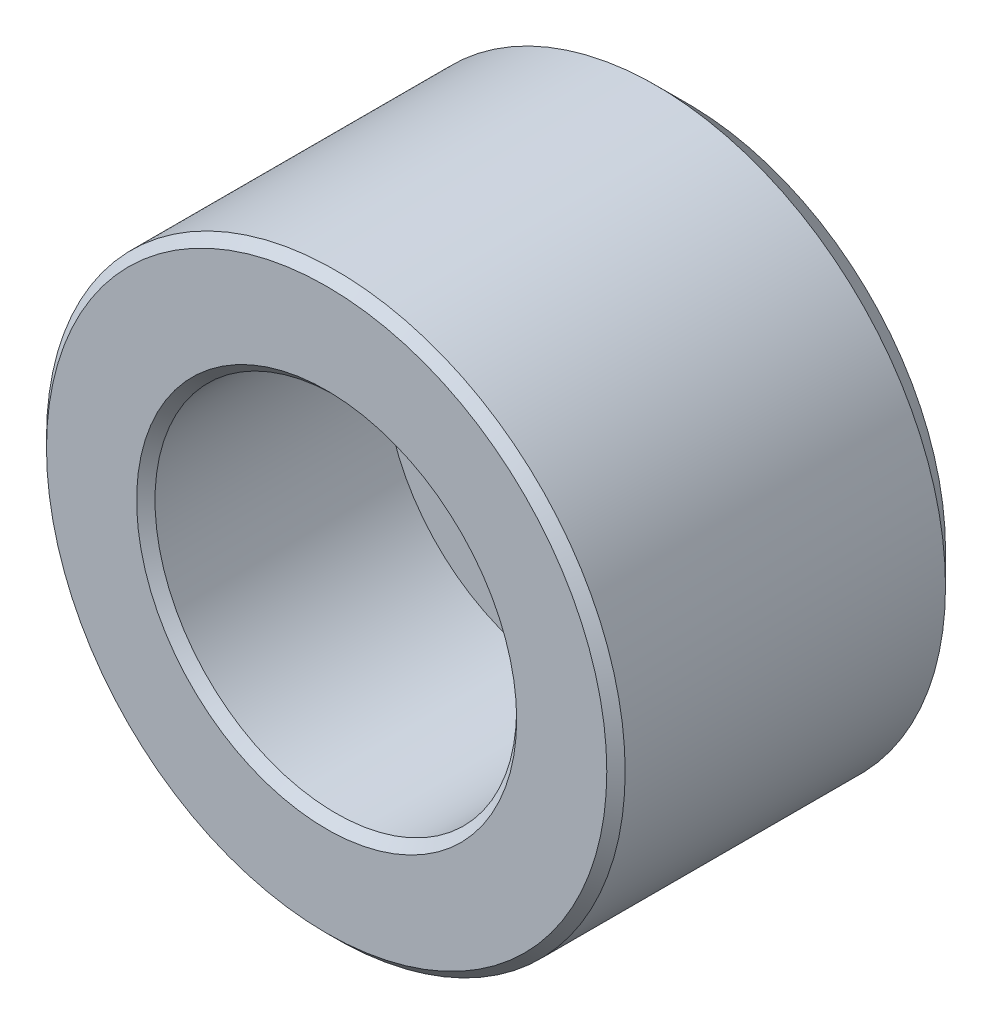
ISO-10303-21;
HEADER;
FILE_DESCRIPTION(('STEP AP214'),'2;1');
FILE_NAME('part.step','',(''),(''),'','','');
FILE_SCHEMA(('AUTOMOTIVE_DESIGN { 1 0 10303 214 1 1 1 1 }'));
ENDSEC;
DATA;
#1=APPLICATION_CONTEXT('core data for automotive mechanical design processes');
#2=APPLICATION_PROTOCOL_DEFINITION('international standard','automotive_design',2000,#1);
#3=PRODUCT_CONTEXT('',#1,'mechanical');
#4=PRODUCT('Part','Part','',(#3));
#5=PRODUCT_RELATED_PRODUCT_CATEGORY('part','',(#4));
#6=PRODUCT_DEFINITION_FORMATION('','',#4);
#7=PRODUCT_DEFINITION_CONTEXT('part definition',#1,'design');
#8=PRODUCT_DEFINITION('design','',#6,#7);
#9=PRODUCT_DEFINITION_SHAPE('','',#8);
#10=(LENGTH_UNIT() NAMED_UNIT(*) SI_UNIT(.MILLI.,.METRE.));
#11=(NAMED_UNIT(*) PLANE_ANGLE_UNIT() SI_UNIT($,.RADIAN.));
#12=(NAMED_UNIT(*) SI_UNIT($,.STERADIAN.) SOLID_ANGLE_UNIT());
#13=UNCERTAINTY_MEASURE_WITH_UNIT(LENGTH_MEASURE(1.E-05),#10,'distance_accuracy_value','');
#14=(GEOMETRIC_REPRESENTATION_CONTEXT(3) GLOBAL_UNCERTAINTY_ASSIGNED_CONTEXT((#13)) GLOBAL_UNIT_ASSIGNED_CONTEXT((#10,
#11,#12)) REPRESENTATION_CONTEXT('',''));
#15=CARTESIAN_POINT('',(0.,0.,0.));
#16=DIRECTION('',(0.,0.,1.));
#17=DIRECTION('',(1.,0.,0.));
#18=AXIS2_PLACEMENT_3D('',#15,#16,#17);
#19=CARTESIAN_POINT('',(0.,0.,0.));
#20=DIRECTION('',(0.,0.,1.));
#21=DIRECTION('',(1.,0.,0.));
#22=AXIS2_PLACEMENT_3D('',#19,#20,#21);
#23=CYLINDRICAL_SURFACE('',#22,8.);
#24=CARTESIAN_POINT('',(0.,0.,0.889));
#25=DIRECTION('',(0.,0.,1.));
#26=DIRECTION('',(1.,0.,0.));
#27=AXIS2_PLACEMENT_3D('',#24,#25,#26);
#28=CIRCLE('',#27,8.);
#29=CARTESIAN_POINT('',(8.,0.,0.889));
#30=VERTEX_POINT('',#29);
#31=EDGE_CURVE('E35',#30,#30,#28,.T.);
#32=ORIENTED_EDGE('',*,*,#31,.T.);
#33=EDGE_LOOP('',(#32));
#34=FACE_BOUND('',#33,.T.);
#35=CARTESIAN_POINT('',(0.,0.,9.746));
#36=DIRECTION('',(0.,0.,1.));
#37=DIRECTION('',(1.,0.,0.));
#38=AXIS2_PLACEMENT_3D('',#35,#36,#37);
#39=CIRCLE('',#38,8.);
#40=CARTESIAN_POINT('',(8.,0.,9.746));
#41=VERTEX_POINT('',#40);
#42=EDGE_CURVE('E38',#41,#41,#39,.F.);
#43=ORIENTED_EDGE('',*,*,#42,.T.);
#44=EDGE_LOOP('',(#43));
#45=FACE_BOUND('',#44,.T.);
#46=ADVANCED_FACE('F12',(#34,#45),#23,.T.);
#47=CARTESIAN_POINT('',(0.,0.,0.));
#48=DIRECTION('',(0.,0.,1.));
#49=DIRECTION('',(1.,0.,0.));
#50=AXIS2_PLACEMENT_3D('',#47,#48,#49);
#51=PLANE('',#50);
#52=CARTESIAN_POINT('',(0.,0.,0.));
#53=DIRECTION('',(0.,0.,1.));
#54=DIRECTION('',(1.,0.,0.));
#55=AXIS2_PLACEMENT_3D('',#52,#53,#54);
#56=CIRCLE('',#55,3.004);
#57=CARTESIAN_POINT('',(3.004,0.,0.));
#58=VERTEX_POINT('',#57);
#59=EDGE_CURVE('E19',#58,#58,#56,.T.);
#60=ORIENTED_EDGE('',*,*,#59,.T.);
#61=EDGE_LOOP('',(#60));
#62=FACE_BOUND('',#61,.T.);
#63=CARTESIAN_POINT('',(0.,0.,0.));
#64=DIRECTION('',(0.,0.,1.));
#65=DIRECTION('',(1.,0.,0.));
#66=AXIS2_PLACEMENT_3D('',#63,#64,#65);
#67=CIRCLE('',#66,7.111);
#68=CARTESIAN_POINT('',(7.111,0.,0.));
#69=VERTEX_POINT('',#68);
#70=EDGE_CURVE('E32',#69,#69,#67,.F.);
#71=ORIENTED_EDGE('',*,*,#70,.T.);
#72=EDGE_LOOP('',(#71));
#73=FACE_BOUND('',#72,.T.);
#74=ADVANCED_FACE('F68',(#62,#73),#51,.F.);
#75=CARTESIAN_POINT('',(0.,0.,10.));
#76=DIRECTION('',(0.,0.,1.));
#77=DIRECTION('',(1.,0.,0.));
#78=AXIS2_PLACEMENT_3D('',#75,#76,#77);
#79=PLANE('',#78);
#80=CARTESIAN_POINT('',(0.,0.,10.));
#81=DIRECTION('',(0.,0.,1.));
#82=DIRECTION('',(1.,0.,0.));
#83=AXIS2_PLACEMENT_3D('',#80,#81,#82);
#84=CIRCLE('',#83,5.254);
#85=CARTESIAN_POINT('',(5.254,0.,10.));
#86=VERTEX_POINT('',#85);
#87=EDGE_CURVE('E23',#86,#86,#84,.F.);
#88=ORIENTED_EDGE('',*,*,#87,.T.);
#89=EDGE_LOOP('',(#88));
#90=FACE_BOUND('',#89,.T.);
#91=CARTESIAN_POINT('',(0.,0.,10.));
#92=DIRECTION('',(0.,0.,1.));
#93=DIRECTION('',(1.,0.,0.));
#94=AXIS2_PLACEMENT_3D('',#91,#92,#93);
#95=CIRCLE('',#94,7.746);
#96=CARTESIAN_POINT('',(7.746,0.,10.));
#97=VERTEX_POINT('',#96);
#98=EDGE_CURVE('E41',#97,#97,#95,.T.);
#99=ORIENTED_EDGE('',*,*,#98,.T.);
#100=EDGE_LOOP('',(#99));
#101=FACE_BOUND('',#100,.T.);
#102=ADVANCED_FACE('F74',(#90,#101),#79,.T.);
#103=CARTESIAN_POINT('',(0.,0.,10.));
#104=DIRECTION('',(0.,0.,-1.));
#105=DIRECTION('',(-1.,0.,0.));
#106=AXIS2_PLACEMENT_3D('',#103,#104,#105);
#107=CONICAL_SURFACE('',#106,7.746,0.785398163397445);
#108=ORIENTED_EDGE('',*,*,#42,.F.);
#109=EDGE_LOOP('',(#108));
#110=FACE_BOUND('',#109,.T.);
#111=ORIENTED_EDGE('',*,*,#98,.F.);
#112=EDGE_LOOP('',(#111));
#113=FACE_BOUND('',#112,.T.);
#114=ADVANCED_FACE('F79',(#110,#113),#107,.T.);
#115=CARTESIAN_POINT('',(0.,0.,0.889));
#116=DIRECTION('',(0.,0.,1.));
#117=DIRECTION('',(1.,0.,0.));
#118=AXIS2_PLACEMENT_3D('',#115,#116,#117);
#119=CONICAL_SURFACE('',#118,8.,0.785398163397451);
#120=ORIENTED_EDGE('',*,*,#70,.F.);
#121=EDGE_LOOP('',(#120));
#122=FACE_BOUND('',#121,.T.);
#123=ORIENTED_EDGE('',*,*,#31,.F.);
#124=EDGE_LOOP('',(#123));
#125=FACE_BOUND('',#124,.T.);
#126=ADVANCED_FACE('F82',(#122,#125),#119,.T.);
#127=CARTESIAN_POINT('',(0.,0.,10.));
#128=DIRECTION('',(0.,0.,1.));
#129=DIRECTION('',(1.,0.,0.));
#130=AXIS2_PLACEMENT_3D('',#127,#128,#129);
#131=CYLINDRICAL_SURFACE('',#130,2.75);
#132=CARTESIAN_POINT('',(0.,0.,0.254));
#133=DIRECTION('',(0.,0.,1.));
#134=DIRECTION('',(1.,0.,0.));
#135=AXIS2_PLACEMENT_3D('',#132,#133,#134);
#136=CIRCLE('',#135,2.75);
#137=CARTESIAN_POINT('',(2.75,0.,0.254));
#138=VERTEX_POINT('',#137);
#139=EDGE_CURVE('E8',#138,#138,#136,.F.);
#140=ORIENTED_EDGE('',*,*,#139,.T.);
#141=EDGE_LOOP('',(#140));
#142=FACE_BOUND('',#141,.T.);
#143=CARTESIAN_POINT('',(0.,0.,3.39599));
#144=DIRECTION('',(0.,0.,1.));
#145=DIRECTION('',(1.,0.,0.));
#146=AXIS2_PLACEMENT_3D('',#143,#144,#145);
#147=CIRCLE('',#146,2.75);
#148=CARTESIAN_POINT('',(2.75,0.,3.39599));
#149=VERTEX_POINT('',#148);
#150=EDGE_CURVE('E44',#149,#149,#147,.T.);
#151=ORIENTED_EDGE('',*,*,#150,.T.);
#152=EDGE_LOOP('',(#151));
#153=FACE_BOUND('',#152,.T.);
#154=ADVANCED_FACE('F64',(#142,#153),#131,.F.);
#155=CARTESIAN_POINT('',(2.75,0.,3.39599));
#156=DIRECTION('',(0.,0.,-1.));
#157=DIRECTION('',(-1.,0.,0.));
#158=AXIS2_PLACEMENT_3D('',#155,#156,#157);
#159=PLANE('',#158);
#160=ORIENTED_EDGE('',*,*,#150,.F.);
#161=EDGE_LOOP('',(#160));
#162=FACE_BOUND('',#161,.T.);
#163=CARTESIAN_POINT('',(0.,0.,3.39599));
#164=DIRECTION('',(0.,0.,1.));
#165=DIRECTION('',(1.,0.,0.));
#166=AXIS2_PLACEMENT_3D('',#163,#164,#165);
#167=CIRCLE('',#166,5.);
#168=CARTESIAN_POINT('',(5.,0.,3.39599));
#169=VERTEX_POINT('',#168);
#170=EDGE_CURVE('E47',#169,#169,#167,.T.);
#171=ORIENTED_EDGE('',*,*,#170,.T.);
#172=EDGE_LOOP('',(#171));
#173=FACE_BOUND('',#172,.T.);
#174=ADVANCED_FACE('F51',(#162,#173),#159,.F.);
#175=CARTESIAN_POINT('',(0.,0.,10.));
#176=DIRECTION('',(0.,0.,1.));
#177=DIRECTION('',(1.,0.,0.));
#178=AXIS2_PLACEMENT_3D('',#175,#176,#177);
#179=CYLINDRICAL_SURFACE('',#178,5.);
#180=CARTESIAN_POINT('',(0.,0.,9.746));
#181=DIRECTION('',(0.,0.,1.));
#182=DIRECTION('',(1.,0.,0.));
#183=AXIS2_PLACEMENT_3D('',#180,#181,#182);
#184=CIRCLE('',#183,5.);
#185=CARTESIAN_POINT('',(5.,0.,9.746));
#186=VERTEX_POINT('',#185);
#187=EDGE_CURVE('E27',#186,#186,#184,.T.);
#188=ORIENTED_EDGE('',*,*,#187,.T.);
#189=EDGE_LOOP('',(#188));
#190=FACE_BOUND('',#189,.T.);
#191=ORIENTED_EDGE('',*,*,#170,.F.);
#192=EDGE_LOOP('',(#191));
#193=FACE_BOUND('',#192,.T.);
#194=ADVANCED_FACE('F53',(#190,#193),#179,.F.);
#195=CARTESIAN_POINT('',(0.,0.,9.746));
#196=DIRECTION('',(0.,0.,1.));
#197=DIRECTION('',(1.,0.,0.));
#198=AXIS2_PLACEMENT_3D('',#195,#196,#197);
#199=CONICAL_SURFACE('',#198,5.,0.785398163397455);
#200=ORIENTED_EDGE('',*,*,#87,.F.);
#201=EDGE_LOOP('',(#200));
#202=FACE_BOUND('',#201,.T.);
#203=ORIENTED_EDGE('',*,*,#187,.F.);
#204=EDGE_LOOP('',(#203));
#205=FACE_BOUND('',#204,.T.);
#206=ADVANCED_FACE('F55',(#202,#205),#199,.F.);
#207=CARTESIAN_POINT('',(0.,0.,0.));
#208=DIRECTION('',(0.,0.,-1.));
#209=DIRECTION('',(-1.,0.,0.));
#210=AXIS2_PLACEMENT_3D('',#207,#208,#209);
#211=CONICAL_SURFACE('',#210,3.004,0.785398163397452);
#212=ORIENTED_EDGE('',*,*,#139,.F.);
#213=EDGE_LOOP('',(#212));
#214=FACE_BOUND('',#213,.T.);
#215=ORIENTED_EDGE('',*,*,#59,.F.);
#216=EDGE_LOOP('',(#215));
#217=FACE_BOUND('',#216,.T.);
#218=ADVANCED_FACE('F14',(#214,#217),#211,.F.);
#219=CLOSED_SHELL('',(#46,#74,#102,#114,#126,#154,#174,#194,#206,#218));
#220=MANIFOLD_SOLID_BREP('B1',#219);
#221=ADVANCED_BREP_SHAPE_REPRESENTATION('',(#18,#220),#14);
#222=SHAPE_DEFINITION_REPRESENTATION(#9,#221);
ENDSEC;
END-ISO-10303-21;
